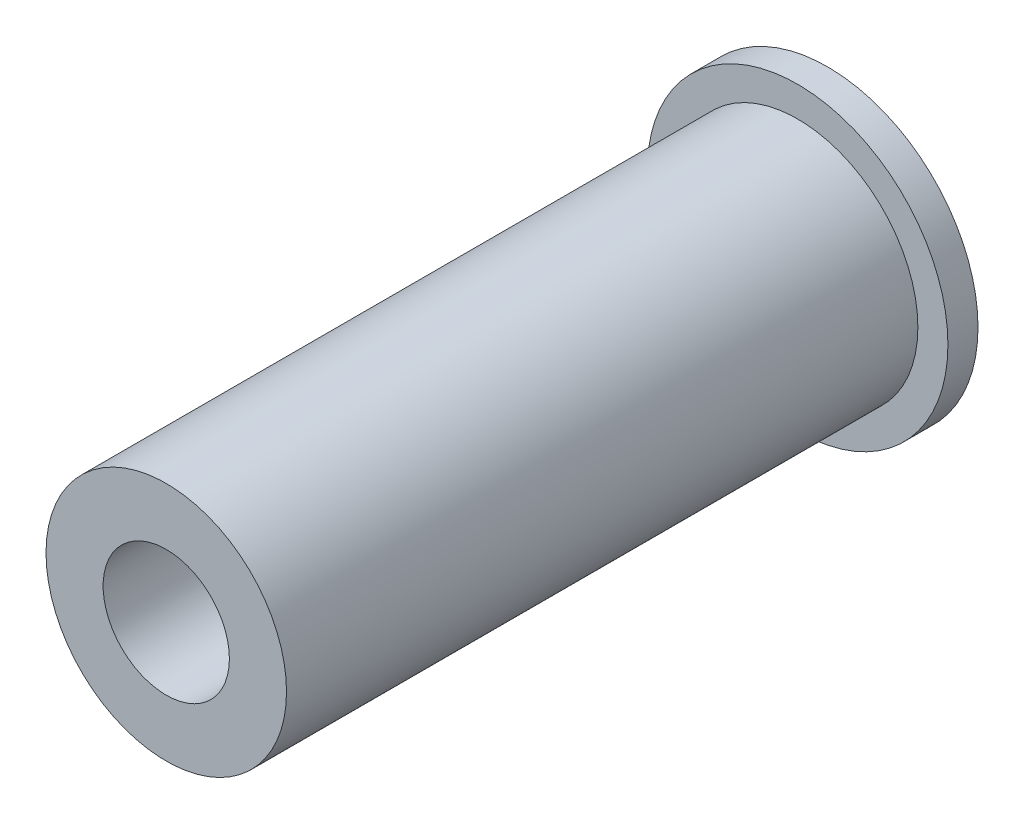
ISO-10303-21;
HEADER;
FILE_DESCRIPTION(('STEP AP214'),'2;1');
FILE_NAME('part.step','',(''),(''),'','','');
FILE_SCHEMA(('AUTOMOTIVE_DESIGN { 1 0 10303 214 1 1 1 1 }'));
ENDSEC;
DATA;
#1=APPLICATION_CONTEXT('core data for automotive mechanical design processes');
#2=APPLICATION_PROTOCOL_DEFINITION('international standard','automotive_design',2000,#1);
#3=PRODUCT_CONTEXT('',#1,'mechanical');
#4=PRODUCT('Part','Part','',(#3));
#5=PRODUCT_RELATED_PRODUCT_CATEGORY('part','',(#4));
#6=PRODUCT_DEFINITION_FORMATION('','',#4);
#7=PRODUCT_DEFINITION_CONTEXT('part definition',#1,'design');
#8=PRODUCT_DEFINITION('design','',#6,#7);
#9=PRODUCT_DEFINITION_SHAPE('','',#8);
#10=(LENGTH_UNIT() NAMED_UNIT(*) SI_UNIT(.MILLI.,.METRE.));
#11=(NAMED_UNIT(*) PLANE_ANGLE_UNIT() SI_UNIT($,.RADIAN.));
#12=(NAMED_UNIT(*) SI_UNIT($,.STERADIAN.) SOLID_ANGLE_UNIT());
#13=UNCERTAINTY_MEASURE_WITH_UNIT(LENGTH_MEASURE(1.E-05),#10,'distance_accuracy_value','');
#14=(GEOMETRIC_REPRESENTATION_CONTEXT(3) GLOBAL_UNCERTAINTY_ASSIGNED_CONTEXT((#13)) GLOBAL_UNIT_ASSIGNED_CONTEXT((#10,
#11,#12)) REPRESENTATION_CONTEXT('',''));
#15=CARTESIAN_POINT('',(0.,0.,0.));
#16=DIRECTION('',(0.,0.,1.));
#17=DIRECTION('',(1.,0.,0.));
#18=AXIS2_PLACEMENT_3D('',#15,#16,#17);
#19=CARTESIAN_POINT('',(0.,0.,22.));
#20=DIRECTION('',(0.,0.,-1.));
#21=DIRECTION('',(-1.,0.,0.));
#22=AXIS2_PLACEMENT_3D('',#19,#20,#21);
#23=CYLINDRICAL_SURFACE('',#22,5.);
#24=CARTESIAN_POINT('',(0.,0.,0.));
#25=DIRECTION('',(0.,0.,1.));
#26=DIRECTION('',(1.,0.,0.));
#27=AXIS2_PLACEMENT_3D('',#24,#25,#26);
#28=CIRCLE('',#27,5.);
#29=CARTESIAN_POINT('',(5.,0.,0.));
#30=VERTEX_POINT('',#29);
#31=EDGE_CURVE('E11',#30,#30,#28,.T.);
#32=ORIENTED_EDGE('',*,*,#31,.T.);
#33=EDGE_LOOP('',(#32));
#34=FACE_BOUND('',#33,.T.);
#35=CARTESIAN_POINT('',(0.,0.,0.999999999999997));
#36=DIRECTION('',(0.,0.,1.));
#37=DIRECTION('',(1.,0.,0.));
#38=AXIS2_PLACEMENT_3D('',#35,#36,#37);
#39=CIRCLE('',#38,5.);
#40=CARTESIAN_POINT('',(5.,0.,0.999999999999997));
#41=VERTEX_POINT('',#40);
#42=EDGE_CURVE('E34',#41,#41,#39,.T.);
#43=ORIENTED_EDGE('',*,*,#42,.F.);
#44=EDGE_LOOP('',(#43));
#45=FACE_BOUND('',#44,.T.);
#46=ADVANCED_FACE('F31',(#34,#45),#23,.T.);
#47=CARTESIAN_POINT('',(0.,0.,0.));
#48=DIRECTION('',(0.,0.,1.));
#49=DIRECTION('',(1.,0.,0.));
#50=AXIS2_PLACEMENT_3D('',#47,#48,#49);
#51=PLANE('',#50);
#52=CARTESIAN_POINT('',(0.,0.,0.));
#53=DIRECTION('',(0.,0.,1.));
#54=DIRECTION('',(1.,0.,0.));
#55=AXIS2_PLACEMENT_3D('',#52,#53,#54);
#56=CIRCLE('',#55,2.1);
#57=CARTESIAN_POINT('',(2.1,0.,0.));
#58=VERTEX_POINT('',#57);
#59=EDGE_CURVE('E46',#58,#58,#56,.T.);
#60=ORIENTED_EDGE('',*,*,#59,.T.);
#61=EDGE_LOOP('',(#60));
#62=FACE_BOUND('',#61,.T.);
#63=ORIENTED_EDGE('',*,*,#31,.F.);
#64=EDGE_LOOP('',(#63));
#65=FACE_BOUND('',#64,.T.);
#66=ADVANCED_FACE('F55',(#62,#65),#51,.F.);
#67=CARTESIAN_POINT('',(0.,0.,0.999999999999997));
#68=DIRECTION('',(0.,0.,1.));
#69=DIRECTION('',(1.,0.,0.));
#70=AXIS2_PLACEMENT_3D('',#67,#68,#69);
#71=PLANE('',#70);
#72=CARTESIAN_POINT('',(0.,0.,0.999999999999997));
#73=DIRECTION('',(0.,0.,1.));
#74=DIRECTION('',(1.,0.,0.));
#75=AXIS2_PLACEMENT_3D('',#72,#73,#74);
#76=CIRCLE('',#75,4.);
#77=CARTESIAN_POINT('',(4.,0.,0.999999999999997));
#78=VERTEX_POINT('',#77);
#79=EDGE_CURVE('E41',#78,#78,#76,.T.);
#80=ORIENTED_EDGE('',*,*,#79,.F.);
#81=EDGE_LOOP('',(#80));
#82=FACE_BOUND('',#81,.T.);
#83=ORIENTED_EDGE('',*,*,#42,.T.);
#84=EDGE_LOOP('',(#83));
#85=FACE_BOUND('',#84,.T.);
#86=ADVANCED_FACE('F72',(#82,#85),#71,.T.);
#87=CARTESIAN_POINT('',(0.,0.,0.999999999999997));
#88=DIRECTION('',(0.,0.,1.));
#89=DIRECTION('',(1.,0.,0.));
#90=AXIS2_PLACEMENT_3D('',#87,#88,#89);
#91=CYLINDRICAL_SURFACE('',#90,4.);
#92=CARTESIAN_POINT('',(0.,0.,22.));
#93=DIRECTION('',(0.,0.,1.));
#94=DIRECTION('',(1.,0.,0.));
#95=AXIS2_PLACEMENT_3D('',#92,#93,#94);
#96=CIRCLE('',#95,4.);
#97=CARTESIAN_POINT('',(4.,0.,22.));
#98=VERTEX_POINT('',#97);
#99=EDGE_CURVE('E43',#98,#98,#96,.T.);
#100=CARTESIAN_POINT('',(4.,0.,0.999999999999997));
#101=CARTESIAN_POINT('',(4.,0.,1.21875));
#102=CARTESIAN_POINT('',(4.,0.,1.4375));
#103=CARTESIAN_POINT('',(4.,0.,1.875));
#104=CARTESIAN_POINT('',(4.,0.,2.09375));
#105=CARTESIAN_POINT('',(4.,0.,2.53125));
#106=CARTESIAN_POINT('',(4.,0.,2.75));
#107=CARTESIAN_POINT('',(4.,0.,3.1875));
#108=CARTESIAN_POINT('',(4.,0.,3.40625));
#109=CARTESIAN_POINT('',(4.,0.,3.84375));
#110=CARTESIAN_POINT('',(4.,0.,4.0625));
#111=CARTESIAN_POINT('',(4.,0.,4.5));
#112=CARTESIAN_POINT('',(4.,0.,4.71875));
#113=CARTESIAN_POINT('',(4.,0.,5.15625));
#114=CARTESIAN_POINT('',(4.,0.,5.375));
#115=CARTESIAN_POINT('',(4.,0.,5.8125));
#116=CARTESIAN_POINT('',(4.,0.,6.03125));
#117=CARTESIAN_POINT('',(4.,0.,6.46875));
#118=CARTESIAN_POINT('',(4.,0.,6.6875));
#119=CARTESIAN_POINT('',(4.,0.,7.125));
#120=CARTESIAN_POINT('',(4.,0.,7.34375));
#121=CARTESIAN_POINT('',(4.,0.,7.78125));
#122=CARTESIAN_POINT('',(4.,0.,8.));
#123=CARTESIAN_POINT('',(4.,0.,8.4375));
#124=CARTESIAN_POINT('',(4.,0.,8.65625));
#125=CARTESIAN_POINT('',(4.,0.,9.09375));
#126=CARTESIAN_POINT('',(4.,0.,9.3125));
#127=CARTESIAN_POINT('',(4.,0.,9.75));
#128=CARTESIAN_POINT('',(4.,0.,9.96875));
#129=CARTESIAN_POINT('',(4.,0.,10.40625));
#130=CARTESIAN_POINT('',(4.,0.,10.625));
#131=CARTESIAN_POINT('',(4.,0.,11.0625));
#132=CARTESIAN_POINT('',(4.,0.,11.28125));
#133=CARTESIAN_POINT('',(4.,0.,11.71875));
#134=CARTESIAN_POINT('',(4.,0.,11.9375));
#135=CARTESIAN_POINT('',(4.,0.,12.375));
#136=CARTESIAN_POINT('',(4.,0.,12.59375));
#137=CARTESIAN_POINT('',(4.,0.,13.03125));
#138=CARTESIAN_POINT('',(4.,0.,13.25));
#139=CARTESIAN_POINT('',(4.,0.,13.6875));
#140=CARTESIAN_POINT('',(4.,0.,13.90625));
#141=CARTESIAN_POINT('',(4.,0.,14.34375));
#142=CARTESIAN_POINT('',(4.,0.,14.5625));
#143=CARTESIAN_POINT('',(4.,0.,15.));
#144=CARTESIAN_POINT('',(4.,0.,15.21875));
#145=CARTESIAN_POINT('',(4.,0.,15.65625));
#146=CARTESIAN_POINT('',(4.,0.,15.875));
#147=CARTESIAN_POINT('',(4.,0.,16.3125));
#148=CARTESIAN_POINT('',(4.,0.,16.53125));
#149=CARTESIAN_POINT('',(4.,0.,16.96875));
#150=CARTESIAN_POINT('',(4.,0.,17.1875));
#151=CARTESIAN_POINT('',(4.,0.,17.625));
#152=CARTESIAN_POINT('',(4.,0.,17.84375));
#153=CARTESIAN_POINT('',(4.,0.,18.28125));
#154=CARTESIAN_POINT('',(4.,0.,18.5));
#155=CARTESIAN_POINT('',(4.,0.,18.9375));
#156=CARTESIAN_POINT('',(4.,0.,19.15625));
#157=CARTESIAN_POINT('',(4.,0.,19.59375));
#158=CARTESIAN_POINT('',(4.,0.,19.8125));
#159=CARTESIAN_POINT('',(4.,0.,20.25));
#160=CARTESIAN_POINT('',(4.,0.,20.46875));
#161=CARTESIAN_POINT('',(4.,0.,20.90625));
#162=CARTESIAN_POINT('',(4.,0.,21.125));
#163=CARTESIAN_POINT('',(4.,0.,21.5625));
#164=CARTESIAN_POINT('',(4.,0.,21.78125));
#165=CARTESIAN_POINT('',(4.,0.,22.));
#166=B_SPLINE_CURVE_WITH_KNOTS('',3,(#100,#101,#102,#103,#104,#105,#106,#107,#108,#109,#110,
#111,#112,#113,#114,#115,#116,#117,#118,#119,#120,#121,#122,#123,#124,#125,#126,#127,#128,#129,
#130,#131,#132,#133,#134,#135,#136,#137,#138,#139,#140,#141,#142,#143,#144,#145,#146,#147,#148,
#149,#150,#151,#152,#153,#154,#155,#156,#157,#158,#159,#160,#161,#162,#163,#164,#165),
.UNSPECIFIED.,.F.,.F.,(4,2,2,2,2,2,2,2,2,2,2,2,2,2,2,2,2,2,2,2,2,2,2,2,2,2,2,2,2,2,2,2,4),(0.,
0.65625,1.3125,1.96875,2.625,3.28125,3.9375,4.59375,5.25,5.90625,6.5625,7.21875,7.875,8.53125,
9.1875,9.84375,10.5,11.15625,11.8125,12.46875,13.125,13.78125,14.4375,15.09375,15.75,16.40625,
17.0625,17.71875,18.375,19.03125,19.6875,20.34375,21.),.UNSPECIFIED.);
#167=EDGE_CURVE('BSEAM67',#78,#98,#166,.T.);
#168=ORIENTED_EDGE('',*,*,#79,.T.);
#169=ORIENTED_EDGE('',*,*,#99,.F.);
#170=ORIENTED_EDGE('',*,*,#167,.T.);
#171=ORIENTED_EDGE('',*,*,#167,.F.);
#172=EDGE_LOOP('',(#168,#170,#169,#171));
#173=FACE_BOUND('',#172,.T.);
#174=ADVANCED_FACE('F67',(#173),#91,.T.);
#175=CARTESIAN_POINT('',(0.,0.,22.));
#176=DIRECTION('',(0.,0.,1.));
#177=DIRECTION('',(1.,0.,0.));
#178=AXIS2_PLACEMENT_3D('',#175,#176,#177);
#179=PLANE('',#178);
#180=CARTESIAN_POINT('',(0.,0.,22.));
#181=DIRECTION('',(0.,0.,1.));
#182=DIRECTION('',(1.,0.,0.));
#183=AXIS2_PLACEMENT_3D('',#180,#181,#182);
#184=CIRCLE('',#183,2.1);
#185=CARTESIAN_POINT('',(2.1,0.,22.));
#186=VERTEX_POINT('',#185);
#187=EDGE_CURVE('E49',#186,#186,#184,.T.);
#188=ORIENTED_EDGE('',*,*,#187,.F.);
#189=EDGE_LOOP('',(#188));
#190=FACE_BOUND('',#189,.T.);
#191=ORIENTED_EDGE('',*,*,#99,.T.);
#192=EDGE_LOOP('',(#191));
#193=FACE_BOUND('',#192,.T.);
#194=ADVANCED_FACE('F61',(#190,#193),#179,.T.);
#195=CARTESIAN_POINT('',(0.,0.,0.));
#196=DIRECTION('',(0.,0.,1.));
#197=DIRECTION('',(1.,0.,0.));
#198=AXIS2_PLACEMENT_3D('',#195,#196,#197);
#199=CYLINDRICAL_SURFACE('',#198,2.1);
#200=ORIENTED_EDGE('',*,*,#59,.F.);
#201=EDGE_LOOP('',(#200));
#202=FACE_BOUND('',#201,.T.);
#203=ORIENTED_EDGE('',*,*,#187,.T.);
#204=EDGE_LOOP('',(#203));
#205=FACE_BOUND('',#204,.T.);
#206=ADVANCED_FACE('F58',(#202,#205),#199,.F.);
#207=CLOSED_SHELL('',(#46,#66,#86,#174,#194,#206));
#208=MANIFOLD_SOLID_BREP('B2',#207);
#209=ADVANCED_BREP_SHAPE_REPRESENTATION('',(#18,#208),#14);
#210=SHAPE_DEFINITION_REPRESENTATION(#9,#209);
ENDSEC;
END-ISO-10303-21;
